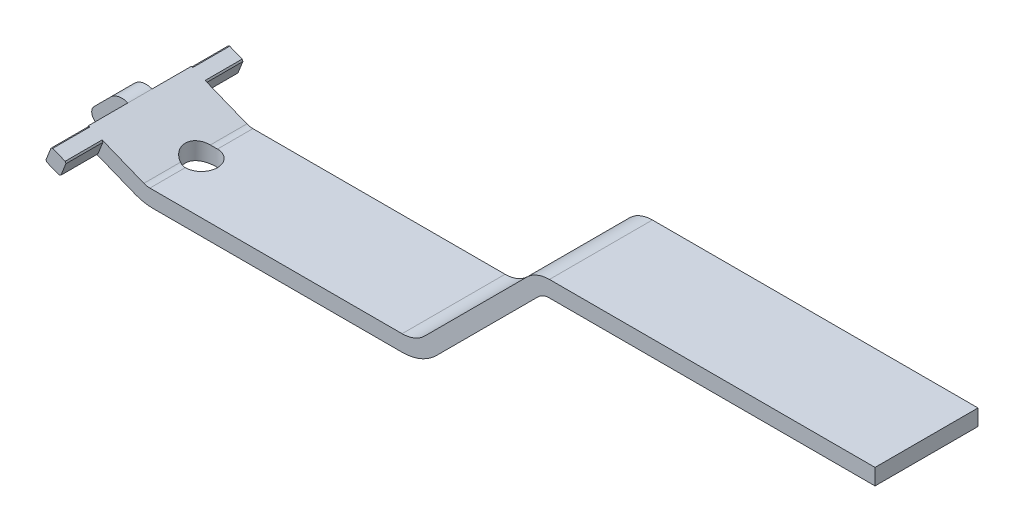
from build123d import *

# Parameters (mm, degrees)
BOSS_EXTRU_1_DEPTH           = 3.2
BOSS_EXTRU_2_DEPTH           = 5.5
ESQUISSE3_OUTSIDE_W          = 61.492
ESQUISSE3_OUTSIDE_H          = 20.736
ESQUISSE3_OUTSIDE_R          = 0.65
ENL_V_MAT_EXTRU_1_DEPTH      = 2.3
ESQUISSE4_OUTSIDE_W          = 61.492
ESQUISSE4_OUTSIDE_H          = 20.736
ESQUISSE4_OUTSIDE_R          = 0.65
ENL_V_MAT_EXTRU_2_DEPTH      = 2.3
BOSS_EXTRU_3_DEPTH           = 0.75
CONG_1_R                     = 3
CONG_2_R                     = 1
ENL_V_MAT_EXTRU_3_DEPTH      = 50.487978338
ENL_V_MAT_EXTRU_3_DEPTH_BACK = 50.487978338
ESQUISSE7_R                  = 1


with BuildPart() as part:
    # Esquisse1 → Boss.-Extru.1 (new, symmetric)
    with BuildSketch(Plane.XY):
        with BuildLine():
            Line((-0.185714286, -0.464230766), (3.153313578, -1.8))
            Line((3.153313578, -1.8), (19.214081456, -1.8))
            ThreePointArc((19.214081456, -1.8), (20.362131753, -1.571638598), (21.335401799, -0.921320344))
            Line((21.335401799, -0.921320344), (27.663828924, 5.407106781))
            ThreePointArc((27.663828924, 5.407106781), (27.988252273, 5.623879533), (28.370935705, 5.7))
            Line((28.370935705, 5.7), (48.606172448, 5.7))
            Line((48.606172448, 5.7), (48.606172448, 6.7))
            Line((48.606172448, 6.7), (28.370935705, 6.7))
            ThreePointArc((28.370935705, 6.7), (27.605568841, 6.547759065), (26.956722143, 6.114213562))
            Line((26.956722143, 6.114213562), (20.628295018, -0.214213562))
            ThreePointArc((20.628295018, -0.214213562), (19.979448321, -0.647759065), (19.214081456, -0.8))
            Line((19.214081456, -0.8), (3.345917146, -0.8))
            Line((3.345917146, -0.8), (0.185714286, 0.464230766))
            Line((0.185714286, 0.464230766), (-0.27851648, 0.649945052))
            Line((-0.27851648, 0.649945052), (-0.649945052, -0.27851648))
            Line((-0.649945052, -0.27851648), (-0.185714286, -0.464230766))
        make_face()
    extrude(amount=BOSS_EXTRU_1_DEPTH, both=True)

    # Esquisse2 → Boss.-Extru.2 (add, symmetric)
    with BuildSketch(Plane.XY):
        Polygon((-0.27851648, 0.649945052), (-0.649945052, -0.27851648), (0.27851648, -0.649945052), (0.649945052, 0.27851648), align=None)
    extrude(amount=BOSS_EXTRU_2_DEPTH, both=True)

    # Esquisse3 outside → Enl_v. mat.-Extru.1 (cut)
    with BuildSketch(Plane.XY.offset(5.5)):
        with Locations((23.978, 2.45)):
            Rectangle(ESQUISSE3_OUTSIDE_W, ESQUISSE3_OUTSIDE_H)
        Circle(ESQUISSE3_OUTSIDE_R, mode=Mode.SUBTRACT)
    extrude(amount=-ENL_V_MAT_EXTRU_1_DEPTH, mode=Mode.SUBTRACT)

    # Esquisse4 outside → Enl_v. mat.-Extru.2 (cut)
    with BuildSketch(Plane(origin=(0, 0, -5.5), x_dir=(-1, 0, 0), z_dir=(0, 0, -1))):
        with Locations((-23.978, 2.45)):
            Rectangle(ESQUISSE4_OUTSIDE_W, ESQUISSE4_OUTSIDE_H)
        Circle(ESQUISSE4_OUTSIDE_R, mode=Mode.SUBTRACT)
    extrude(amount=-ENL_V_MAT_EXTRU_2_DEPTH, mode=Mode.SUBTRACT)

    # Esquisse6 → Boss.-Extru.3 (add, symmetric)
    with BuildSketch(Plane.XY):
        with BuildLine():
            Line((-0.649945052, -0.27851648), (-1.674981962, -1.303553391))
            ThreePointArc((-1.674981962, -1.303553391), (-2.382088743, -1.303553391), (-2.382088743, -0.596446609))
            Line((-2.382088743, -0.596446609), (-1.357051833, 0.428590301))
            ThreePointArc((-1.357051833, 0.428590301), (-0.850990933, 0.701065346), (-0.27851648, 0.649945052))
            Line((-0.27851648, 0.649945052), (-0.649945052, -0.27851648))
        make_face()
    extrude(amount=BOSS_EXTRU_3_DEPTH, both=True)

    # Cong_1
    cong_1_edges = [part.edges().sort_by_distance(p)[0] for p in [
        (3.153313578, -1.8, 0),
    ]]
    fillet(cong_1_edges, radius=CONG_1_R)

    # Cong_2
    cong_2_edges = [part.edges().sort_by_distance(p)[0] for p in [
        (3.345917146, -0.8, 0),
    ]]
    fillet(cong_2_edges, radius=CONG_2_R)

    # Esquisse7 → Enl_v. mat.-Extru.3 (cut, two sides: drawn at the far end of the back side and taken through both)
    with BuildSketch(Plane(origin=(0, -0.8, 0), x_dir=(1, 0, 0), z_dir=(0, 1, 0)).offset(-ENL_V_MAT_EXTRU_3_DEPTH_BACK)):
        with Locations(Location((3.538520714, 0, 0), (0, 0, 270))):
            Circle(ESQUISSE7_R)
    extrude(amount=ENL_V_MAT_EXTRU_3_DEPTH + ENL_V_MAT_EXTRU_3_DEPTH_BACK, mode=Mode.SUBTRACT)


solid = part.part
